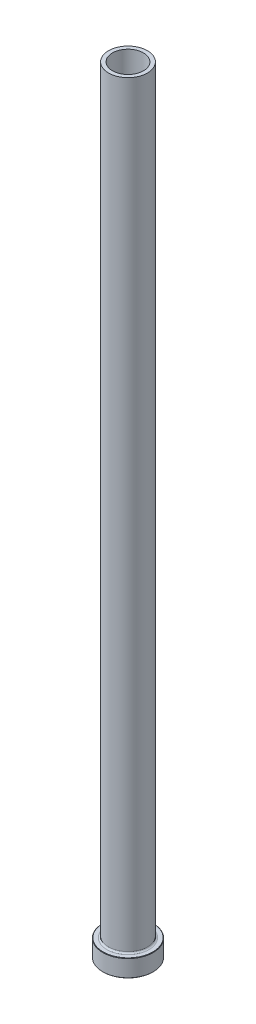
ISO-10303-21;
HEADER;
FILE_DESCRIPTION(('STEP AP214'),'2;1');
FILE_NAME('part.step','',(''),(''),'','','');
FILE_SCHEMA(('AUTOMOTIVE_DESIGN { 1 0 10303 214 1 1 1 1 }'));
ENDSEC;
DATA;
#1=APPLICATION_CONTEXT('core data for automotive mechanical design processes');
#2=APPLICATION_PROTOCOL_DEFINITION('international standard','automotive_design',2000,#1);
#3=PRODUCT_CONTEXT('',#1,'mechanical');
#4=PRODUCT('Part','Part','',(#3));
#5=PRODUCT_RELATED_PRODUCT_CATEGORY('part','',(#4));
#6=PRODUCT_DEFINITION_FORMATION('','',#4);
#7=PRODUCT_DEFINITION_CONTEXT('part definition',#1,'design');
#8=PRODUCT_DEFINITION('design','',#6,#7);
#9=PRODUCT_DEFINITION_SHAPE('','',#8);
#10=(LENGTH_UNIT() NAMED_UNIT(*) SI_UNIT(.MILLI.,.METRE.));
#11=(NAMED_UNIT(*) PLANE_ANGLE_UNIT() SI_UNIT($,.RADIAN.));
#12=(NAMED_UNIT(*) SI_UNIT($,.STERADIAN.) SOLID_ANGLE_UNIT());
#13=UNCERTAINTY_MEASURE_WITH_UNIT(LENGTH_MEASURE(1.E-05),#10,'distance_accuracy_value','');
#14=(GEOMETRIC_REPRESENTATION_CONTEXT(3) GLOBAL_UNCERTAINTY_ASSIGNED_CONTEXT((#13)) GLOBAL_UNIT_ASSIGNED_CONTEXT((#10,
#11,#12)) REPRESENTATION_CONTEXT('',''));
#15=CARTESIAN_POINT('',(0.,0.,0.));
#16=DIRECTION('',(0.,0.,1.));
#17=DIRECTION('',(1.,0.,0.));
#18=AXIS2_PLACEMENT_3D('',#15,#16,#17);
#19=CARTESIAN_POINT('',(0.,92.1876809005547,0.));
#20=DIRECTION('',(0.,1.,0.));
#21=DIRECTION('',(0.,0.,1.));
#22=AXIS2_PLACEMENT_3D('',#19,#20,#21);
#23=CYLINDRICAL_SURFACE('',#22,8.00000000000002);
#24=CARTESIAN_POINT('',(0.,400.,0.));
#25=DIRECTION('',(0.,1.,0.));
#26=DIRECTION('',(0.,0.,1.));
#27=AXIS2_PLACEMENT_3D('',#24,#25,#26);
#28=CIRCLE('',#27,8.00000000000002);
#29=CARTESIAN_POINT('',(0.,400.,8.00000000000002));
#30=VERTEX_POINT('',#29);
#31=EDGE_CURVE('E62',#30,#30,#28,.T.);
#32=ORIENTED_EDGE('',*,*,#31,.T.);
#33=EDGE_LOOP('',(#32));
#34=FACE_BOUND('',#33,.T.);
#35=CARTESIAN_POINT('',(0.,345.,0.));
#36=DIRECTION('',(0.,1.,0.));
#37=DIRECTION('',(0.,0.,1.));
#38=AXIS2_PLACEMENT_3D('',#35,#36,#37);
#39=CIRCLE('',#38,8.00000000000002);
#40=CARTESIAN_POINT('',(0.,345.,8.00000000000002));
#41=VERTEX_POINT('',#40);
#42=EDGE_CURVE('E71',#41,#41,#39,.T.);
#43=ORIENTED_EDGE('',*,*,#42,.F.);
#44=EDGE_LOOP('',(#43));
#45=FACE_BOUND('',#44,.T.);
#46=ADVANCED_FACE('F30',(#34,#45),#23,.F.);
#47=CARTESIAN_POINT('',(-8.00000000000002,400.,0.));
#48=DIRECTION('',(0.,1.,0.));
#49=DIRECTION('',(0.,0.,1.));
#50=AXIS2_PLACEMENT_3D('',#47,#48,#49);
#51=PLANE('',#50);
#52=CARTESIAN_POINT('',(0.,400.,0.));
#53=DIRECTION('',(0.,1.,0.));
#54=DIRECTION('',(0.,0.,1.));
#55=AXIS2_PLACEMENT_3D('',#52,#53,#54);
#56=CIRCLE('',#55,10.);
#57=CARTESIAN_POINT('',(0.,400.,10.));
#58=VERTEX_POINT('',#57);
#59=EDGE_CURVE('E65',#58,#58,#56,.T.);
#60=ORIENTED_EDGE('',*,*,#59,.T.);
#61=EDGE_LOOP('',(#60));
#62=FACE_BOUND('',#61,.T.);
#63=ORIENTED_EDGE('',*,*,#31,.F.);
#64=EDGE_LOOP('',(#63));
#65=FACE_BOUND('',#64,.T.);
#66=ADVANCED_FACE('F79',(#62,#65),#51,.T.);
#67=CARTESIAN_POINT('',(0.,92.1876809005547,0.));
#68=DIRECTION('',(0.,1.,0.));
#69=DIRECTION('',(0.,0.,1.));
#70=AXIS2_PLACEMENT_3D('',#67,#68,#69);
#71=CYLINDRICAL_SURFACE('',#70,10.);
#72=CARTESIAN_POINT('',(0.,9.8,0.));
#73=DIRECTION('',(0.,1.,0.));
#74=DIRECTION('',(0.,0.,1.));
#75=AXIS2_PLACEMENT_3D('',#72,#73,#74);
#76=CIRCLE('',#75,10.);
#77=CARTESIAN_POINT('',(0.,9.8,10.));
#78=VERTEX_POINT('',#77);
#79=EDGE_CURVE('E59',#78,#78,#76,.T.);
#80=ORIENTED_EDGE('',*,*,#79,.T.);
#81=EDGE_LOOP('',(#80));
#82=FACE_BOUND('',#81,.T.);
#83=ORIENTED_EDGE('',*,*,#59,.F.);
#84=EDGE_LOOP('',(#83));
#85=FACE_BOUND('',#84,.T.);
#86=ADVANCED_FACE('F85',(#82,#85),#71,.T.);
#87=CARTESIAN_POINT('',(-9.99999999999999,9.,0.));
#88=DIRECTION('',(0.,1.,0.));
#89=DIRECTION('',(0.,0.,1.));
#90=AXIS2_PLACEMENT_3D('',#87,#88,#89);
#91=PLANE('',#90);
#92=CARTESIAN_POINT('',(0.,9.,0.));
#93=DIRECTION('',(0.,1.,0.));
#94=DIRECTION('',(0.,0.,1.));
#95=AXIS2_PLACEMENT_3D('',#92,#93,#94);
#96=CIRCLE('',#95,12.8);
#97=CARTESIAN_POINT('',(0.,9.,12.8));
#98=VERTEX_POINT('',#97);
#99=EDGE_CURVE('E53',#98,#98,#96,.T.);
#100=ORIENTED_EDGE('',*,*,#99,.T.);
#101=EDGE_LOOP('',(#100));
#102=FACE_BOUND('',#101,.T.);
#103=CARTESIAN_POINT('',(0.,9.,0.));
#104=DIRECTION('',(0.,1.,0.));
#105=DIRECTION('',(0.,0.,1.));
#106=AXIS2_PLACEMENT_3D('',#103,#104,#105);
#107=CIRCLE('',#106,10.8);
#108=CARTESIAN_POINT('',(0.,9.,10.8));
#109=VERTEX_POINT('',#108);
#110=EDGE_CURVE('E56',#109,#109,#107,.F.);
#111=ORIENTED_EDGE('',*,*,#110,.T.);
#112=EDGE_LOOP('',(#111));
#113=FACE_BOUND('',#112,.T.);
#114=ADVANCED_FACE('F111',(#102,#113),#91,.T.);
#115=CARTESIAN_POINT('',(0.,92.1876809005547,0.));
#116=DIRECTION('',(0.,1.,0.));
#117=DIRECTION('',(0.,0.,1.));
#118=AXIS2_PLACEMENT_3D('',#115,#116,#117);
#119=CYLINDRICAL_SURFACE('',#118,13.);
#120=CARTESIAN_POINT('',(0.,8.79999999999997,0.));
#121=DIRECTION('',(0.,1.,0.));
#122=DIRECTION('',(0.,0.,1.));
#123=AXIS2_PLACEMENT_3D('',#120,#121,#122);
#124=CIRCLE('',#123,13.);
#125=CARTESIAN_POINT('',(0.,8.79999999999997,13.));
#126=VERTEX_POINT('',#125);
#127=EDGE_CURVE('E45',#126,#126,#124,.F.);
#128=ORIENTED_EDGE('',*,*,#127,.T.);
#129=EDGE_LOOP('',(#128));
#130=FACE_BOUND('',#129,.T.);
#131=CARTESIAN_POINT('',(0.,0.20000000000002,0.));
#132=DIRECTION('',(0.,-1.,0.));
#133=DIRECTION('',(0.,0.,-1.));
#134=AXIS2_PLACEMENT_3D('',#131,#132,#133);
#135=CIRCLE('',#134,13.);
#136=CARTESIAN_POINT('',(0.,0.20000000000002,-13.));
#137=VERTEX_POINT('',#136);
#138=EDGE_CURVE('E50',#137,#137,#135,.F.);
#139=ORIENTED_EDGE('',*,*,#138,.T.);
#140=EDGE_LOOP('',(#139));
#141=FACE_BOUND('',#140,.T.);
#142=ADVANCED_FACE('F108',(#130,#141),#119,.T.);
#143=CARTESIAN_POINT('',(-13.,0.,0.));
#144=DIRECTION('',(0.,-1.,0.));
#145=DIRECTION('',(0.,0.,-1.));
#146=AXIS2_PLACEMENT_3D('',#143,#144,#145);
#147=PLANE('',#146);
#148=CARTESIAN_POINT('',(0.,0.,0.));
#149=DIRECTION('',(0.,-1.,0.));
#150=DIRECTION('',(0.,0.,-1.));
#151=AXIS2_PLACEMENT_3D('',#148,#149,#150);
#152=CIRCLE('',#151,8.74999999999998);
#153=CARTESIAN_POINT('',(0.,0.,-8.74999999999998));
#154=VERTEX_POINT('',#153);
#155=EDGE_CURVE('E37',#154,#154,#152,.F.);
#156=ORIENTED_EDGE('',*,*,#155,.T.);
#157=EDGE_LOOP('',(#156));
#158=FACE_BOUND('',#157,.T.);
#159=CARTESIAN_POINT('',(0.,0.,0.));
#160=DIRECTION('',(0.,-1.,0.));
#161=DIRECTION('',(0.,0.,-1.));
#162=AXIS2_PLACEMENT_3D('',#159,#160,#161);
#163=CIRCLE('',#162,12.8);
#164=CARTESIAN_POINT('',(0.,0.,-12.8));
#165=VERTEX_POINT('',#164);
#166=EDGE_CURVE('E41',#165,#165,#163,.T.);
#167=ORIENTED_EDGE('',*,*,#166,.T.);
#168=EDGE_LOOP('',(#167));
#169=FACE_BOUND('',#168,.T.);
#170=ADVANCED_FACE('F110',(#158,#169),#147,.T.);
#171=CARTESIAN_POINT('',(0.,92.1876809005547,0.));
#172=DIRECTION('',(0.,1.,0.));
#173=DIRECTION('',(0.,0.,1.));
#174=AXIS2_PLACEMENT_3D('',#171,#172,#173);
#175=CYLINDRICAL_SURFACE('',#174,8.25000000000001);
#176=CARTESIAN_POINT('',(0.,0.5,0.));
#177=DIRECTION('',(0.,-1.,0.));
#178=DIRECTION('',(0.,0.,-1.));
#179=AXIS2_PLACEMENT_3D('',#176,#177,#178);
#180=CIRCLE('',#179,8.25000000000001);
#181=CARTESIAN_POINT('',(0.,0.5,-8.25000000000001));
#182=VERTEX_POINT('',#181);
#183=EDGE_CURVE('E10',#182,#182,#180,.T.);
#184=ORIENTED_EDGE('',*,*,#183,.T.);
#185=EDGE_LOOP('',(#184));
#186=FACE_BOUND('',#185,.T.);
#187=CARTESIAN_POINT('',(0.,333.,0.));
#188=DIRECTION('',(0.,1.,0.));
#189=DIRECTION('',(0.,0.,1.));
#190=AXIS2_PLACEMENT_3D('',#187,#188,#189);
#191=CIRCLE('',#190,8.25000000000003);
#192=CARTESIAN_POINT('',(0.,333.,8.25000000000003));
#193=VERTEX_POINT('',#192);
#194=EDGE_CURVE('E68',#193,#193,#191,.T.);
#195=ORIENTED_EDGE('',*,*,#194,.T.);
#196=EDGE_LOOP('',(#195));
#197=FACE_BOUND('',#196,.T.);
#198=ADVANCED_FACE('F118',(#186,#197),#175,.F.);
#199=CARTESIAN_POINT('',(0.,333.,0.));
#200=DIRECTION('',(0.,-1.,0.));
#201=DIRECTION('',(0.,0.,-1.));
#202=AXIS2_PLACEMENT_3D('',#199,#200,#201);
#203=CONICAL_SURFACE('',#202,8.25000000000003,0.0208303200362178);
#204=ORIENTED_EDGE('',*,*,#42,.T.);
#205=EDGE_LOOP('',(#204));
#206=FACE_BOUND('',#205,.T.);
#207=ORIENTED_EDGE('',*,*,#194,.F.);
#208=EDGE_LOOP('',(#207));
#209=FACE_BOUND('',#208,.T.);
#210=ADVANCED_FACE('F75',(#206,#209),#203,.F.);
#211=CARTESIAN_POINT('',(0.,9.8,0.));
#212=DIRECTION('',(0.,1.,0.));
#213=DIRECTION('',(0.,0.,1.));
#214=AXIS2_PLACEMENT_3D('',#211,#212,#213);
#215=TOROIDAL_SURFACE('',#214,10.8,0.8);
#216=ORIENTED_EDGE('',*,*,#110,.F.);
#217=EDGE_LOOP('',(#216));
#218=FACE_BOUND('',#217,.T.);
#219=ORIENTED_EDGE('',*,*,#79,.F.);
#220=EDGE_LOOP('',(#219));
#221=FACE_BOUND('',#220,.T.);
#222=ADVANCED_FACE('F90',(#218,#221),#215,.F.);
#223=CARTESIAN_POINT('',(0.,8.99999999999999,0.));
#224=DIRECTION('',(0.,-1.,0.));
#225=DIRECTION('',(0.,0.,-1.));
#226=AXIS2_PLACEMENT_3D('',#223,#224,#225);
#227=CONICAL_SURFACE('',#226,12.8,0.785398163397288);
#228=ORIENTED_EDGE('',*,*,#127,.F.);
#229=EDGE_LOOP('',(#228));
#230=FACE_BOUND('',#229,.T.);
#231=ORIENTED_EDGE('',*,*,#99,.F.);
#232=EDGE_LOOP('',(#231));
#233=FACE_BOUND('',#232,.T.);
#234=ADVANCED_FACE('F93',(#230,#233),#227,.T.);
#235=CARTESIAN_POINT('',(0.,0.20000000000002,0.));
#236=DIRECTION('',(0.,1.,0.));
#237=DIRECTION('',(0.,0.,1.));
#238=AXIS2_PLACEMENT_3D('',#235,#236,#237);
#239=CONICAL_SURFACE('',#238,13.,0.785398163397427);
#240=ORIENTED_EDGE('',*,*,#166,.F.);
#241=EDGE_LOOP('',(#240));
#242=FACE_BOUND('',#241,.T.);
#243=ORIENTED_EDGE('',*,*,#138,.F.);
#244=EDGE_LOOP('',(#243));
#245=FACE_BOUND('',#244,.T.);
#246=ADVANCED_FACE('F96',(#242,#245),#239,.T.);
#247=CARTESIAN_POINT('',(0.,0.,0.));
#248=DIRECTION('',(0.,-1.,0.));
#249=DIRECTION('',(0.,0.,-1.));
#250=AXIS2_PLACEMENT_3D('',#247,#248,#249);
#251=CONICAL_SURFACE('',#250,8.74999999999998,0.785398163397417);
#252=ORIENTED_EDGE('',*,*,#183,.F.);
#253=EDGE_LOOP('',(#252));
#254=FACE_BOUND('',#253,.T.);
#255=ORIENTED_EDGE('',*,*,#155,.F.);
#256=EDGE_LOOP('',(#255));
#257=FACE_BOUND('',#256,.T.);
#258=ADVANCED_FACE('F32',(#254,#257),#251,.F.);
#259=CLOSED_SHELL('',(#46,#66,#86,#114,#142,#170,#198,#210,#222,#234,#246,#258));
#260=MANIFOLD_SOLID_BREP('B2',#259);
#261=ADVANCED_BREP_SHAPE_REPRESENTATION('',(#18,#260),#14);
#262=SHAPE_DEFINITION_REPRESENTATION(#9,#261);
ENDSEC;
END-ISO-10303-21;
